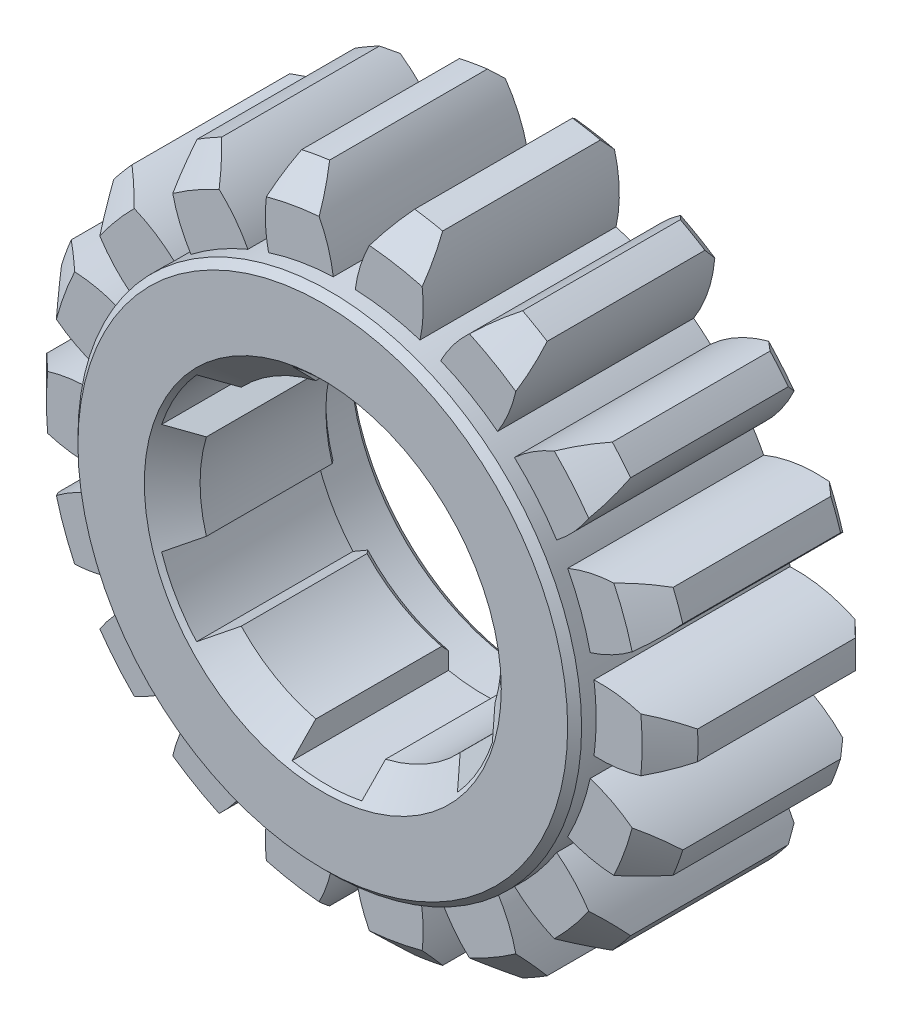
from build123d import *
from build123d.topology import SkipClean

# Parameters (mm, degrees)
SKETCH1_R               = 23.36
GEAR_BLANK_DEPTH        = 7.03
FRONT_GEAR_CHAMFER_SIZE = 2
REAR_GEAR_CHAMFER_SIZE  = 0.75
TOOTH_CUT_DEPTH         = 7.03
TOOTH_COPIES_COUNT      = 18
BOSS_EXTRUDE1_START     = 1.54
SKETCH3_R               = 18.06
BOSS_EXTRUDE1_DEPTH     = 1.54
CHAMFER1_SIZE           = 0.5
SKETCH4_R               = 13.1
CUT_EXTRUDE1_DEPTH      = 4.08
SKETCH5_R               = 10.8
CUT_EXTRUDE2_DEPTH      = 35.853876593
CHAMFER2_SIZE           = 0.5
CHAMFER3_SIZE           = 2
ONE_SPLINE_CUT_DEPTH    = 35.853876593
SPLINE_CUT_COPIES_COUNT = 6


with BuildPart() as part:
    # Sketch1 → Gear Blank (new, symmetric)
    with BuildSketch(Plane.XY):
        Circle(SKETCH1_R)
    extrude(amount=GEAR_BLANK_DEPTH, both=True)

    # Front Gear Chamfer
    front_gear_chamfer_edges = [part.edges().sort_by_distance(p)[0] for p in [
        (-23.36, 0, 7.03),
    ]]
    chamfer(front_gear_chamfer_edges, length=FRONT_GEAR_CHAMFER_SIZE)

    # Rear Gear Chamfer
    rear_gear_chamfer_edges = [part.edges().sort_by_distance(p)[0] for p in [
        (-23.36, 0, -7.03),
    ]]
    chamfer(rear_gear_chamfer_edges, length=REAR_GEAR_CHAMFER_SIZE)

    # Sketch2 → Tooth Cut (cut, symmetric)
    with BuildSketch(Plane.XY):
        with BuildLine():
            ThreePointArc((3.049081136, 23.160153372), (-1.0806e-05, 23.36), (-3.049102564, 23.160150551))
            ThreePointArc((-3.049102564, 23.160150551), (-1.553273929, 20.762845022), (-0.787774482, 18.042810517))
            ThreePointArc((-0.787774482, 18.042810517), (-8.355e-06, 18.06), (0.787757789, 18.042811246))
            ThreePointArc((0.787757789, 18.042811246), (1.553254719, 20.762846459), (3.049081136, 23.160153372))
        make_face()
    tooth_cut = extrude(amount=TOOTH_CUT_DEPTH, both=True, mode=Mode.SUBTRACT)

    # Tooth Copies: Tooth Cut ×18 about axis
    tooth_copies_axis = Axis((0, 0, 0), (0, 0, 1))
    for i in range(1, TOOTH_COPIES_COUNT):
        add(tooth_cut.rotate(tooth_copies_axis, i * 360 / TOOTH_COPIES_COUNT), mode=Mode.SUBTRACT)

    # Sketch3 → Boss-Extrude1 (add)
    with SkipClean():  # the faces are left unmerged after this step: merging them gives an invalid solid
        with BuildSketch(Plane.XY.offset(7.03).offset(BOSS_EXTRUDE1_START)):
            Circle(SKETCH3_R)
        extrude(amount=-BOSS_EXTRUDE1_DEPTH)

    # Chamfer1
    chamfer1_edges = [part.edges().sort_by_distance(p)[0] for p in [
        (-18.06, 0, 8.57),
    ]]
    chamfer(chamfer1_edges, length=CHAMFER1_SIZE)

    # Sketch4 → Cut-Extrude1 (cut)
    with SkipClean():  # the faces are left unmerged after this step: merging them gives an invalid solid
        with BuildSketch(Plane(origin=(0, 0, -7.03), x_dir=(-1, 0, 0), z_dir=(0, 0, -1))):
            Circle(SKETCH4_R)
        extrude(amount=-CUT_EXTRUDE1_DEPTH, mode=Mode.SUBTRACT)

    # Sketch5 → Cut-Extrude2 (cut, through all)
    with SkipClean():  # the faces are left unmerged after this step: merging them gives an invalid solid
        with BuildSketch(Plane(origin=(0, 0, -2.95), x_dir=(-1, 0, 0), z_dir=(0, 0, -1))):
            Circle(SKETCH5_R)
        extrude(amount=-CUT_EXTRUDE2_DEPTH, mode=Mode.SUBTRACT)

    # Chamfer2
    chamfer2_edges = [part.edges().sort_by_distance(p)[0] for p in [
        (13.1, 0, -7.03),
        (10.8, 0, -2.95),
    ]]
    chamfer(chamfer2_edges, length=CHAMFER2_SIZE)

    # Chamfer3
    chamfer3_edges = [part.edges().sort_by_distance(p)[0] for p in [
        (10.8, 0, 8.57),
    ]]
    chamfer(chamfer3_edges, length=CHAMFER3_SIZE)

    # Sketch6 → One Spline Cut (cut, through all)
    with SkipClean():  # the faces are left unmerged after this step: merging them gives an invalid solid
        with BuildSketch(Plane(origin=(0, 0, -2.95), x_dir=(-1, 0, 0), z_dir=(0, 0, -1))):
            with BuildLine():
                Line((2.5, -12.247448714), (2.5, -10.506664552))
                ThreePointArc((2.5, -10.506664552), (0, -10.8), (-2.5, -10.506664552))
                Line((-2.5, -10.506664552), (-2.5, -12.247448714))
                ThreePointArc((-2.5, -12.247448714), (0, -12.5), (2.5, -12.247448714))
            make_face()
        one_spline_cut = extrude(amount=-ONE_SPLINE_CUT_DEPTH, mode=Mode.SUBTRACT)

    # Spline Cut Copies: One Spline Cut ×6 about axis
    with SkipClean():  # the faces are left unmerged after this step: merging them gives an invalid solid
        spline_cut_copies_axis = Axis((0, 0, 0), (0, 0, 1))
        for i in range(1, SPLINE_CUT_COPIES_COUNT):
            add(one_spline_cut.rotate(spline_cut_copies_axis, i * 360 / SPLINE_CUT_COPIES_COUNT), mode=Mode.SUBTRACT)


solid = part.part
